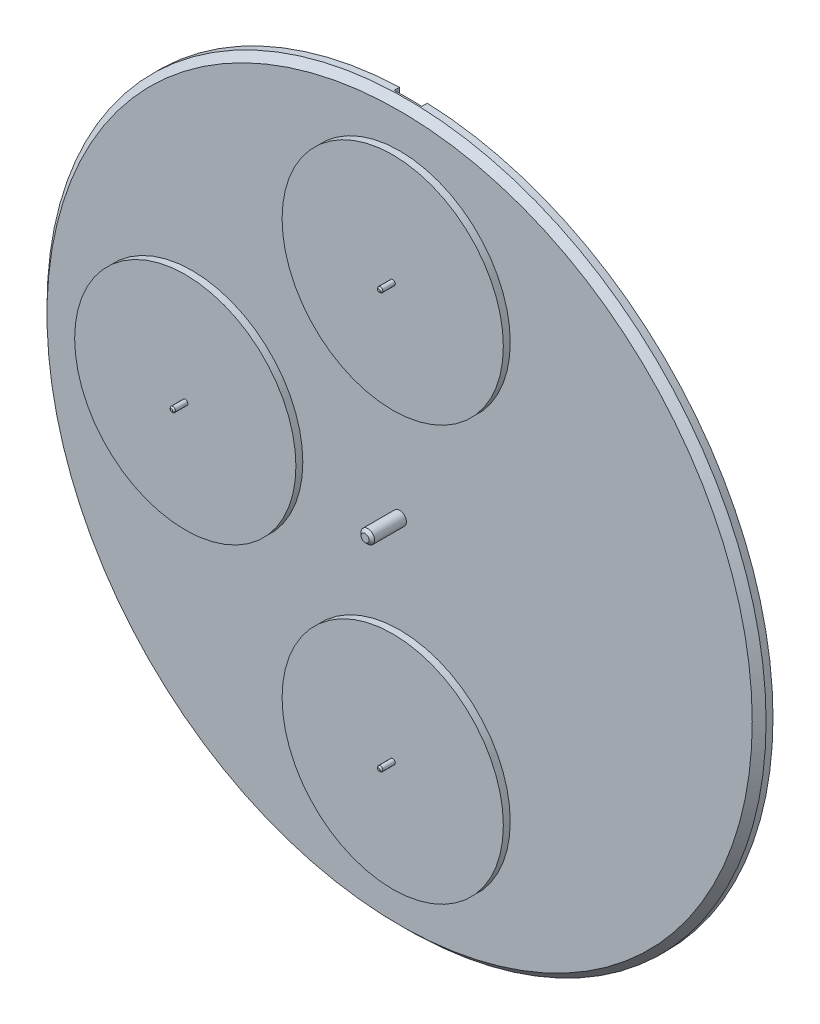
from build123d import *

# Parameters (mm, degrees)
SKETCH1_R           = 13
BASE_EXTRUDE_DEPTH  = 0.5
SKETCH2_R           = 4
BOSS_EXTRUDE1_DEPTH = 0.25
SKETCH3_R           = 0.09375
BOSS_EXTRUDE2_DEPTH = 0.75
SKETCH4_R           = 0.245
BOSS_EXTRUDE3_DEPTH = 1.25
SKETCH5_W           = 1
SKETCH5_H           = 2
CUT_EXTRUDE1_DEPTH  = 0.2
CHAMFER1_SIZE       = 0.1
CHAMFER2_SIZE       = 0.05
CHAMFER4_SIZE       = 0.25


with BuildPart() as part:
    # Sketch1 → Base-Extrude (new body)
    with BuildSketch(Plane.XY):
        Circle(SKETCH1_R)
    extrude(amount=-BASE_EXTRUDE_DEPTH)

    # Sketch2 → Boss-Extrude1 (add)
    with BuildSketch(Plane.XY):
        with Locations((-7.5, 0)):
            Circle(SKETCH2_R)
        with Locations((0, 7.5)):
            Circle(SKETCH2_R)
        with Locations((0, -7.5)):
            Circle(SKETCH2_R)
    extrude(amount=BOSS_EXTRUDE1_DEPTH)

    # Sketch3 → Boss-Extrude2 (add)
    with BuildSketch(Plane.XY):
        with Locations((-7.5, 0)):
            Circle(SKETCH3_R)
        with Locations((0, 7.5)):
            Circle(SKETCH3_R)
        with Locations((0, -7.5)):
            Circle(SKETCH3_R)
    extrude(amount=BOSS_EXTRUDE2_DEPTH)

    # Sketch4 → Boss-Extrude3 (add)
    with BuildSketch(Plane.XY):
        Circle(SKETCH4_R)
    extrude(amount=BOSS_EXTRUDE3_DEPTH)

    # Sketch5 → Cut-Extrude1 (cut)
    with BuildSketch(Plane(origin=(0, 0, -0.5), x_dir=(-1, 0, 0), z_dir=(0, 0, -1))):
        with Locations((0, 13)):
            Rectangle(SKETCH5_W, SKETCH5_H)
    extrude(amount=-CUT_EXTRUDE1_DEPTH, mode=Mode.SUBTRACT)

    # Chamfer1
    chamfer1_edges = [part.edges().sort_by_distance(p)[0] for p in [
        (-0.245, 0, 1.25),
    ]]
    chamfer(chamfer1_edges, length=CHAMFER1_SIZE)

    # Chamfer2
    chamfer2_edges = [part.edges().sort_by_distance(p)[0] for p in [
        (-7.59375, 0, 0.75),
        (-0.09375, 7.5, 0.75),
        (-0.09375, -7.5, 0.75),
    ]]
    chamfer(chamfer2_edges, length=CHAMFER2_SIZE)

    # Chamfer4
    chamfer4_edges = [part.edges().sort_by_distance(p)[0] for p in [
        (-13, 0, 0),
    ]]
    chamfer(chamfer4_edges, length=CHAMFER4_SIZE)


solid = part.part
